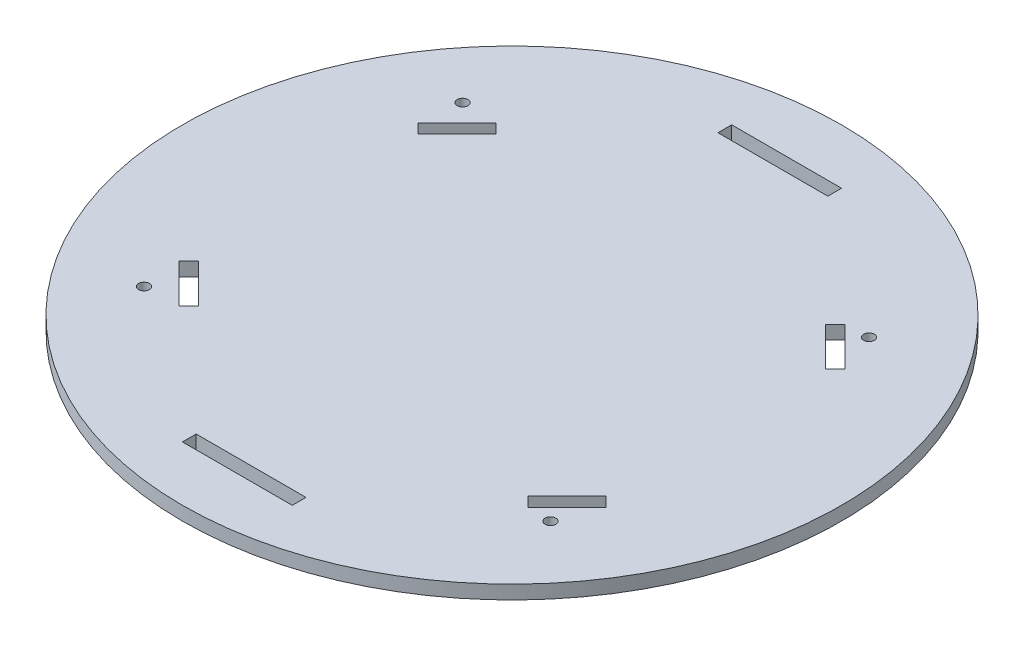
ISO-10303-21;
HEADER;
FILE_DESCRIPTION(('STEP AP214'),'2;1');
FILE_NAME('part.step','',(''),(''),'','','');
FILE_SCHEMA(('AUTOMOTIVE_DESIGN { 1 0 10303 214 1 1 1 1 }'));
ENDSEC;
DATA;
#1=APPLICATION_CONTEXT('core data for automotive mechanical design processes');
#2=APPLICATION_PROTOCOL_DEFINITION('international standard','automotive_design',2000,#1);
#3=PRODUCT_CONTEXT('',#1,'mechanical');
#4=PRODUCT('Part','Part','',(#3));
#5=PRODUCT_RELATED_PRODUCT_CATEGORY('part','',(#4));
#6=PRODUCT_DEFINITION_FORMATION('','',#4);
#7=PRODUCT_DEFINITION_CONTEXT('part definition',#1,'design');
#8=PRODUCT_DEFINITION('design','',#6,#7);
#9=PRODUCT_DEFINITION_SHAPE('','',#8);
#10=(LENGTH_UNIT() NAMED_UNIT(*) SI_UNIT(.MILLI.,.METRE.));
#11=(NAMED_UNIT(*) PLANE_ANGLE_UNIT() SI_UNIT($,.RADIAN.));
#12=(NAMED_UNIT(*) SI_UNIT($,.STERADIAN.) SOLID_ANGLE_UNIT());
#13=UNCERTAINTY_MEASURE_WITH_UNIT(LENGTH_MEASURE(1.E-05),#10,'distance_accuracy_value','');
#14=(GEOMETRIC_REPRESENTATION_CONTEXT(3) GLOBAL_UNCERTAINTY_ASSIGNED_CONTEXT((#13)) GLOBAL_UNIT_ASSIGNED_CONTEXT((#10,
#11,#12)) REPRESENTATION_CONTEXT('',''));
#15=CARTESIAN_POINT('',(0.,0.,0.));
#16=DIRECTION('',(0.,0.,1.));
#17=DIRECTION('',(1.,0.,0.));
#18=AXIS2_PLACEMENT_3D('',#15,#16,#17);
#19=CARTESIAN_POINT('',(0.,1.5875,0.));
#20=DIRECTION('',(0.,-1.,0.));
#21=DIRECTION('',(0.,0.,-1.));
#22=AXIS2_PLACEMENT_3D('',#19,#20,#21);
#23=CYLINDRICAL_SURFACE('',#22,76.2);
#24=CARTESIAN_POINT('',(0.,1.5875,0.));
#25=DIRECTION('',(0.,1.,0.));
#26=DIRECTION('',(0.,0.,1.));
#27=AXIS2_PLACEMENT_3D('',#24,#25,#26);
#28=CIRCLE('',#27,76.2);
#29=CARTESIAN_POINT('',(0.,1.5875,76.2));
#30=VERTEX_POINT('',#29);
#31=EDGE_CURVE('E11',#30,#30,#28,.T.);
#32=ORIENTED_EDGE('',*,*,#31,.F.);
#33=EDGE_LOOP('',(#32));
#34=FACE_BOUND('',#33,.T.);
#35=CARTESIAN_POINT('',(0.,-1.5875,0.));
#36=DIRECTION('',(0.,1.,0.));
#37=DIRECTION('',(0.,0.,1.));
#38=AXIS2_PLACEMENT_3D('',#35,#36,#37);
#39=CIRCLE('',#38,76.2);
#40=CARTESIAN_POINT('',(0.,-1.5875,76.2));
#41=VERTEX_POINT('',#40);
#42=EDGE_CURVE('E33',#41,#41,#39,.T.);
#43=ORIENTED_EDGE('',*,*,#42,.T.);
#44=EDGE_LOOP('',(#43));
#45=FACE_BOUND('',#44,.T.);
#46=ADVANCED_FACE('F30',(#34,#45),#23,.T.);
#47=CARTESIAN_POINT('',(0.,1.5875,0.));
#48=DIRECTION('',(0.,1.,0.));
#49=DIRECTION('',(0.,0.,1.));
#50=AXIS2_PLACEMENT_3D('',#47,#48,#49);
#51=PLANE('',#50);
#52=CARTESIAN_POINT('',(-48.26,1.5875,-36.83));
#53=DIRECTION('',(0.,1.,0.));
#54=DIRECTION('',(0.,0.,1.));
#55=AXIS2_PLACEMENT_3D('',#52,#53,#54);
#56=CIRCLE('',#55,1.24459999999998);
#57=CARTESIAN_POINT('',(-48.26,1.5875,-35.5854));
#58=VERTEX_POINT('',#57);
#59=EDGE_CURVE('E540',#58,#58,#56,.T.);
#60=ORIENTED_EDGE('',*,*,#59,.F.);
#61=EDGE_LOOP('',(#60));
#62=FACE_BOUND('',#61,.T.);
#63=CARTESIAN_POINT('',(45.72,1.5875,-36.83));
#64=DIRECTION('',(0.,1.,0.));
#65=DIRECTION('',(0.,0.,1.));
#66=AXIS2_PLACEMENT_3D('',#63,#64,#65);
#67=CIRCLE('',#66,1.24459999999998);
#68=CARTESIAN_POINT('',(45.72,1.5875,-35.5854));
#69=VERTEX_POINT('',#68);
#70=EDGE_CURVE('E542',#69,#69,#67,.T.);
#71=ORIENTED_EDGE('',*,*,#70,.F.);
#72=EDGE_LOOP('',(#71));
#73=FACE_BOUND('',#72,.T.);
#74=CARTESIAN_POINT('',(45.72,1.5875,36.83));
#75=DIRECTION('',(0.,1.,0.));
#76=DIRECTION('',(0.,0.,1.));
#77=AXIS2_PLACEMENT_3D('',#74,#75,#76);
#78=CIRCLE('',#77,1.24459999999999);
#79=CARTESIAN_POINT('',(45.72,1.5875,38.0746));
#80=VERTEX_POINT('',#79);
#81=EDGE_CURVE('E550',#80,#80,#78,.T.);
#82=ORIENTED_EDGE('',*,*,#81,.F.);
#83=EDGE_LOOP('',(#82));
#84=FACE_BOUND('',#83,.T.);
#85=CARTESIAN_POINT('',(-48.26,1.5875,36.83));
#86=DIRECTION('',(0.,1.,0.));
#87=DIRECTION('',(0.,0.,1.));
#88=AXIS2_PLACEMENT_3D('',#85,#86,#87);
#89=CIRCLE('',#88,1.24459999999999);
#90=CARTESIAN_POINT('',(-48.26,1.5875,38.0746));
#91=VERTEX_POINT('',#90);
#92=EDGE_CURVE('E555',#91,#91,#89,.T.);
#93=ORIENTED_EDGE('',*,*,#92,.F.);
#94=EDGE_LOOP('',(#93));
#95=FACE_BOUND('',#94,.T.);
#96=DIRECTION('',(0.,0.,1.));
#97=VECTOR('',#96,1.);
#98=CARTESIAN_POINT('',(-12.7000000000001,1.5875,-60.325));
#99=LINE('',#98,#97);
#100=CARTESIAN_POINT('',(-12.7000000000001,1.5875,-63.5));
#101=VERTEX_POINT('',#100);
#102=CARTESIAN_POINT('',(-12.7000000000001,1.5875,-60.325));
#103=VERTEX_POINT('',#102);
#104=EDGE_CURVE('E44',#101,#103,#99,.T.);
#105=ORIENTED_EDGE('',*,*,#104,.F.);
#106=DIRECTION('',(-1.,0.,0.));
#107=VECTOR('',#106,1.);
#108=CARTESIAN_POINT('',(-12.7000000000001,1.5875,-63.5));
#109=LINE('',#108,#107);
#110=CARTESIAN_POINT('',(12.6999999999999,1.5875,-63.5));
#111=VERTEX_POINT('',#110);
#112=EDGE_CURVE('E208',#111,#101,#109,.T.);
#113=ORIENTED_EDGE('',*,*,#112,.F.);
#114=DIRECTION('',(0.,0.,-1.));
#115=VECTOR('',#114,1.);
#116=CARTESIAN_POINT('',(12.6999999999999,1.5875,-60.325));
#117=LINE('',#116,#115);
#118=CARTESIAN_POINT('',(12.6999999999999,1.5875,-60.325));
#119=VERTEX_POINT('',#118);
#120=EDGE_CURVE('E211',#119,#111,#117,.T.);
#121=ORIENTED_EDGE('',*,*,#120,.F.);
#122=DIRECTION('',(1.,0.,0.));
#123=VECTOR('',#122,1.);
#124=CARTESIAN_POINT('',(-12.7000000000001,1.5875,-60.325));
#125=LINE('',#124,#123);
#126=EDGE_CURVE('E220',#103,#119,#125,.T.);
#127=ORIENTED_EDGE('',*,*,#126,.F.);
#128=EDGE_LOOP('',(#105,#113,#121,#127));
#129=FACE_BOUND('',#128,.T.);
#130=DIRECTION('',(0.,0.,-1.));
#131=VECTOR('',#130,1.);
#132=CARTESIAN_POINT('',(12.7,1.5875,60.325));
#133=LINE('',#132,#131);
#134=CARTESIAN_POINT('',(12.7,1.5875,63.5));
#135=VERTEX_POINT('',#134);
#136=CARTESIAN_POINT('',(12.7,1.5875,60.325));
#137=VERTEX_POINT('',#136);
#138=EDGE_CURVE('E226',#135,#137,#133,.T.);
#139=ORIENTED_EDGE('',*,*,#138,.F.);
#140=DIRECTION('',(1.,0.,0.));
#141=VECTOR('',#140,1.);
#142=CARTESIAN_POINT('',(-12.7,1.5875,63.5));
#143=LINE('',#142,#141);
#144=CARTESIAN_POINT('',(-12.7,1.5875,63.5));
#145=VERTEX_POINT('',#144);
#146=EDGE_CURVE('E234',#145,#135,#143,.T.);
#147=ORIENTED_EDGE('',*,*,#146,.F.);
#148=DIRECTION('',(0.,0.,1.));
#149=VECTOR('',#148,1.);
#150=CARTESIAN_POINT('',(-12.7,1.5875,60.325));
#151=LINE('',#150,#149);
#152=CARTESIAN_POINT('',(-12.7,1.5875,60.325));
#153=VERTEX_POINT('',#152);
#154=EDGE_CURVE('E248',#153,#145,#151,.T.);
#155=ORIENTED_EDGE('',*,*,#154,.F.);
#156=DIRECTION('',(-1.,0.,0.));
#157=VECTOR('',#156,1.);
#158=CARTESIAN_POINT('',(-12.7,1.5875,60.325));
#159=LINE('',#158,#157);
#160=EDGE_CURVE('E245',#137,#153,#159,.T.);
#161=ORIENTED_EDGE('',*,*,#160,.F.);
#162=EDGE_LOOP('',(#139,#147,#155,#161));
#163=FACE_BOUND('',#162,.T.);
#164=DIRECTION('',(0.707106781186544,0.,-0.707106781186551));
#165=VECTOR('',#164,1.);
#166=CARTESIAN_POINT('',(-40.3450640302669,1.5875,36.6253201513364));
#167=LINE('',#166,#165);
#168=CARTESIAN_POINT('',(-40.3450640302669,1.5875,36.6253201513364));
#169=VERTEX_POINT('',#168);
#170=CARTESIAN_POINT('',(-38.0999999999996,1.5875,34.3802561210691));
#171=VERTEX_POINT('',#170);
#172=EDGE_CURVE('E255',#169,#171,#167,.T.);
#173=ORIENTED_EDGE('',*,*,#172,.F.);
#174=DIRECTION('',(0.707106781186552,0.,0.707106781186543));
#175=VECTOR('',#174,1.);
#176=CARTESIAN_POINT('',(-40.3450640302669,1.5875,36.6253201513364));
#177=LINE('',#176,#175);
#178=CARTESIAN_POINT('',(-49.3253201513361,1.5875,27.6450640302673));
#179=VERTEX_POINT('',#178);
#180=EDGE_CURVE('E266',#179,#169,#177,.T.);
#181=ORIENTED_EDGE('',*,*,#180,.F.);
#182=DIRECTION('',(-0.707106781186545,0.,0.70710678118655));
#183=VECTOR('',#182,1.);
#184=CARTESIAN_POINT('',(-49.3253201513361,1.5875,27.6450640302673));
#185=LINE('',#184,#183);
#186=CARTESIAN_POINT('',(-47.0802561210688,1.5875,25.4));
#187=VERTEX_POINT('',#186);
#188=EDGE_CURVE('E280',#187,#179,#185,.T.);
#189=ORIENTED_EDGE('',*,*,#188,.F.);
#190=DIRECTION('',(-0.707106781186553,0.,-0.707106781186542));
#191=VECTOR('',#190,1.);
#192=CARTESIAN_POINT('',(-38.0999999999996,1.5875,34.3802561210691));
#193=LINE('',#192,#191);
#194=EDGE_CURVE('E277',#171,#187,#193,.T.);
#195=ORIENTED_EDGE('',*,*,#194,.F.);
#196=EDGE_LOOP('',(#173,#181,#189,#195));
#197=FACE_BOUND('',#196,.T.);
#198=DIRECTION('',(0.707106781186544,0.,0.707106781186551));
#199=VECTOR('',#198,1.);
#200=CARTESIAN_POINT('',(40.3450640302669,1.5875,36.6253201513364));
#201=LINE('',#200,#199);
#202=CARTESIAN_POINT('',(38.0999999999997,1.5875,34.3802561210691));
#203=VERTEX_POINT('',#202);
#204=CARTESIAN_POINT('',(40.3450640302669,1.5875,36.6253201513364));
#205=VERTEX_POINT('',#204);
#206=EDGE_CURVE('E287',#203,#205,#201,.T.);
#207=ORIENTED_EDGE('',*,*,#206,.F.);
#208=DIRECTION('',(-0.707106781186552,0.,0.707106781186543));
#209=VECTOR('',#208,1.);
#210=CARTESIAN_POINT('',(38.0999999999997,1.5875,34.3802561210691));
#211=LINE('',#210,#209);
#212=CARTESIAN_POINT('',(47.0802561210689,1.5875,25.4));
#213=VERTEX_POINT('',#212);
#214=EDGE_CURVE('E298',#213,#203,#211,.T.);
#215=ORIENTED_EDGE('',*,*,#214,.F.);
#216=DIRECTION('',(-0.707106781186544,0.,-0.707106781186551));
#217=VECTOR('',#216,1.);
#218=CARTESIAN_POINT('',(49.3253201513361,1.5875,27.6450640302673));
#219=LINE('',#218,#217);
#220=CARTESIAN_POINT('',(49.3253201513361,1.5875,27.6450640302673));
#221=VERTEX_POINT('',#220);
#222=EDGE_CURVE('E312',#221,#213,#219,.T.);
#223=ORIENTED_EDGE('',*,*,#222,.F.);
#224=DIRECTION('',(0.707106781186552,0.,-0.707106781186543));
#225=VECTOR('',#224,1.);
#226=CARTESIAN_POINT('',(40.3450640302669,1.5875,36.6253201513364));
#227=LINE('',#226,#225);
#228=EDGE_CURVE('E309',#205,#221,#227,.T.);
#229=ORIENTED_EDGE('',*,*,#228,.F.);
#230=EDGE_LOOP('',(#207,#215,#223,#229));
#231=FACE_BOUND('',#230,.T.);
#232=DIRECTION('',(-0.707106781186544,0.,0.707106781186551));
#233=VECTOR('',#232,1.);
#234=CARTESIAN_POINT('',(40.3450640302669,1.5875,-36.6253201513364));
#235=LINE('',#234,#233);
#236=CARTESIAN_POINT('',(40.3450640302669,1.5875,-36.6253201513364));
#237=VERTEX_POINT('',#236);
#238=CARTESIAN_POINT('',(38.0999999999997,1.5875,-34.3802561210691));
#239=VERTEX_POINT('',#238);
#240=EDGE_CURVE('E319',#237,#239,#235,.T.);
#241=ORIENTED_EDGE('',*,*,#240,.F.);
#242=DIRECTION('',(-0.707106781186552,0.,-0.707106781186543));
#243=VECTOR('',#242,1.);
#244=CARTESIAN_POINT('',(40.3450640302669,1.5875,-36.6253201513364));
#245=LINE('',#244,#243);
#246=CARTESIAN_POINT('',(49.3253201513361,1.5875,-27.6450640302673));
#247=VERTEX_POINT('',#246);
#248=EDGE_CURVE('E330',#247,#237,#245,.T.);
#249=ORIENTED_EDGE('',*,*,#248,.F.);
#250=DIRECTION('',(0.707106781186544,0.,-0.707106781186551));
#251=VECTOR('',#250,1.);
#252=CARTESIAN_POINT('',(49.3253201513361,1.5875,-27.6450640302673));
#253=LINE('',#252,#251);
#254=CARTESIAN_POINT('',(47.0802561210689,1.5875,-25.4));
#255=VERTEX_POINT('',#254);
#256=EDGE_CURVE('E344',#255,#247,#253,.T.);
#257=ORIENTED_EDGE('',*,*,#256,.F.);
#258=DIRECTION('',(0.707106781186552,0.,0.707106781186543));
#259=VECTOR('',#258,1.);
#260=CARTESIAN_POINT('',(38.0999999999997,1.5875,-34.3802561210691));
#261=LINE('',#260,#259);
#262=EDGE_CURVE('E341',#239,#255,#261,.T.);
#263=ORIENTED_EDGE('',*,*,#262,.F.);
#264=EDGE_LOOP('',(#241,#249,#257,#263));
#265=FACE_BOUND('',#264,.T.);
#266=DIRECTION('',(-0.707106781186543,0.,-0.707106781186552));
#267=VECTOR('',#266,1.);
#268=CARTESIAN_POINT('',(-40.3450640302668,1.5875,-36.6253201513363));
#269=LINE('',#268,#267);
#270=CARTESIAN_POINT('',(-38.0999999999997,1.5875,-34.3802561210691));
#271=VERTEX_POINT('',#270);
#272=CARTESIAN_POINT('',(-40.3450640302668,1.5875,-36.6253201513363));
#273=VERTEX_POINT('',#272);
#274=EDGE_CURVE('E351',#271,#273,#269,.T.);
#275=ORIENTED_EDGE('',*,*,#274,.F.);
#276=DIRECTION('',(0.707106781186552,0.,-0.707106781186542));
#277=VECTOR('',#276,1.);
#278=CARTESIAN_POINT('',(-38.0999999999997,1.5875,-34.3802561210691));
#279=LINE('',#278,#277);
#280=CARTESIAN_POINT('',(-47.0802561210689,1.5875,-25.4));
#281=VERTEX_POINT('',#280);
#282=EDGE_CURVE('E362',#281,#271,#279,.T.);
#283=ORIENTED_EDGE('',*,*,#282,.F.);
#284=DIRECTION('',(0.707106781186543,0.,0.707106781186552));
#285=VECTOR('',#284,1.);
#286=CARTESIAN_POINT('',(-49.3253201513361,1.5875,-27.6450640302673));
#287=LINE('',#286,#285);
#288=CARTESIAN_POINT('',(-49.3253201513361,1.5875,-27.6450640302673));
#289=VERTEX_POINT('',#288);
#290=EDGE_CURVE('E376',#289,#281,#287,.T.);
#291=ORIENTED_EDGE('',*,*,#290,.F.);
#292=DIRECTION('',(-0.70710678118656,0.,0.707106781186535));
#293=VECTOR('',#292,1.);
#294=CARTESIAN_POINT('',(-40.3450640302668,1.5875,-36.6253201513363));
#295=LINE('',#294,#293);
#296=EDGE_CURVE('E373',#273,#289,#295,.T.);
#297=ORIENTED_EDGE('',*,*,#296,.F.);
#298=EDGE_LOOP('',(#275,#283,#291,#297));
#299=FACE_BOUND('',#298,.T.);
#300=ORIENTED_EDGE('',*,*,#31,.T.);
#301=EDGE_LOOP('',(#300));
#302=FACE_BOUND('',#301,.T.);
#303=ADVANCED_FACE('F398',(#62,#73,#84,#95,#129,#163,#197,#231,#265,#299,#302),#51,.T.);
#304=CARTESIAN_POINT('',(0.,-1.5875,0.));
#305=DIRECTION('',(0.,1.,0.));
#306=DIRECTION('',(0.,0.,1.));
#307=AXIS2_PLACEMENT_3D('',#304,#305,#306);
#308=PLANE('',#307);
#309=CARTESIAN_POINT('',(-48.26,-1.5875,-36.83));
#310=DIRECTION('',(0.,1.,0.));
#311=DIRECTION('',(0.,0.,1.));
#312=AXIS2_PLACEMENT_3D('',#309,#310,#311);
#313=CIRCLE('',#312,1.2446);
#314=CARTESIAN_POINT('',(-48.26,-1.5875,-35.5854));
#315=VERTEX_POINT('',#314);
#316=EDGE_CURVE('E537',#315,#315,#313,.T.);
#317=ORIENTED_EDGE('',*,*,#316,.T.);
#318=EDGE_LOOP('',(#317));
#319=FACE_BOUND('',#318,.T.);
#320=CARTESIAN_POINT('',(45.72,-1.5875,-36.83));
#321=DIRECTION('',(0.,1.,0.));
#322=DIRECTION('',(0.,0.,1.));
#323=AXIS2_PLACEMENT_3D('',#320,#321,#322);
#324=CIRCLE('',#323,1.2446);
#325=CARTESIAN_POINT('',(45.72,-1.5875,-35.5854));
#326=VERTEX_POINT('',#325);
#327=EDGE_CURVE('E547',#326,#326,#324,.T.);
#328=ORIENTED_EDGE('',*,*,#327,.T.);
#329=EDGE_LOOP('',(#328));
#330=FACE_BOUND('',#329,.T.);
#331=CARTESIAN_POINT('',(45.72,-1.5875,36.83));
#332=DIRECTION('',(0.,1.,0.));
#333=DIRECTION('',(0.,0.,1.));
#334=AXIS2_PLACEMENT_3D('',#331,#332,#333);
#335=CIRCLE('',#334,1.2446);
#336=CARTESIAN_POINT('',(45.72,-1.5875,38.0746));
#337=VERTEX_POINT('',#336);
#338=EDGE_CURVE('E553',#337,#337,#335,.T.);
#339=ORIENTED_EDGE('',*,*,#338,.T.);
#340=EDGE_LOOP('',(#339));
#341=FACE_BOUND('',#340,.T.);
#342=CARTESIAN_POINT('',(-48.26,-1.5875,36.83));
#343=DIRECTION('',(0.,1.,0.));
#344=DIRECTION('',(0.,0.,1.));
#345=AXIS2_PLACEMENT_3D('',#342,#343,#344);
#346=CIRCLE('',#345,1.2446);
#347=CARTESIAN_POINT('',(-48.26,-1.5875,38.0746));
#348=VERTEX_POINT('',#347);
#349=EDGE_CURVE('E214',#348,#348,#346,.T.);
#350=ORIENTED_EDGE('',*,*,#349,.T.);
#351=EDGE_LOOP('',(#350));
#352=FACE_BOUND('',#351,.T.);
#353=DIRECTION('',(-1.,0.,0.));
#354=VECTOR('',#353,1.);
#355=CARTESIAN_POINT('',(-12.7000000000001,-1.5875,-63.5));
#356=LINE('',#355,#354);
#357=CARTESIAN_POINT('',(12.6999999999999,-1.5875,-63.5));
#358=VERTEX_POINT('',#357);
#359=CARTESIAN_POINT('',(-12.7000000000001,-1.5875,-63.5));
#360=VERTEX_POINT('',#359);
#361=EDGE_CURVE('E198',#358,#360,#356,.T.);
#362=ORIENTED_EDGE('',*,*,#361,.T.);
#363=DIRECTION('',(0.,0.,1.));
#364=VECTOR('',#363,1.);
#365=CARTESIAN_POINT('',(-12.7000000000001,-1.5875,-60.325));
#366=LINE('',#365,#364);
#367=CARTESIAN_POINT('',(-12.7000000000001,-1.5875,-60.325));
#368=VERTEX_POINT('',#367);
#369=EDGE_CURVE('E192',#360,#368,#366,.T.);
#370=ORIENTED_EDGE('',*,*,#369,.T.);
#371=DIRECTION('',(1.,0.,0.));
#372=VECTOR('',#371,1.);
#373=CARTESIAN_POINT('',(-12.7000000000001,-1.5875,-60.325));
#374=LINE('',#373,#372);
#375=CARTESIAN_POINT('',(12.6999999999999,-1.5875,-60.325));
#376=VERTEX_POINT('',#375);
#377=EDGE_CURVE('E201',#368,#376,#374,.T.);
#378=ORIENTED_EDGE('',*,*,#377,.T.);
#379=DIRECTION('',(0.,0.,-1.));
#380=VECTOR('',#379,1.);
#381=CARTESIAN_POINT('',(12.6999999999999,-1.5875,-60.325));
#382=LINE('',#381,#380);
#383=EDGE_CURVE('E52',#376,#358,#382,.T.);
#384=ORIENTED_EDGE('',*,*,#383,.T.);
#385=EDGE_LOOP('',(#362,#370,#378,#384));
#386=FACE_BOUND('',#385,.T.);
#387=DIRECTION('',(1.,0.,0.));
#388=VECTOR('',#387,1.);
#389=CARTESIAN_POINT('',(-12.7,-1.5875,63.5));
#390=LINE('',#389,#388);
#391=CARTESIAN_POINT('',(-12.7,-1.5875,63.5));
#392=VERTEX_POINT('',#391);
#393=CARTESIAN_POINT('',(12.7,-1.5875,63.5));
#394=VERTEX_POINT('',#393);
#395=EDGE_CURVE('E240',#392,#394,#390,.T.);
#396=ORIENTED_EDGE('',*,*,#395,.T.);
#397=DIRECTION('',(0.,0.,-1.));
#398=VECTOR('',#397,1.);
#399=CARTESIAN_POINT('',(12.7,-1.5875,60.325));
#400=LINE('',#399,#398);
#401=CARTESIAN_POINT('',(12.7,-1.5875,60.325));
#402=VERTEX_POINT('',#401);
#403=EDGE_CURVE('E230',#394,#402,#400,.T.);
#404=ORIENTED_EDGE('',*,*,#403,.T.);
#405=DIRECTION('',(-1.,0.,0.));
#406=VECTOR('',#405,1.);
#407=CARTESIAN_POINT('',(-12.7,-1.5875,60.325));
#408=LINE('',#407,#406);
#409=CARTESIAN_POINT('',(-12.7,-1.5875,60.325));
#410=VERTEX_POINT('',#409);
#411=EDGE_CURVE('E233',#402,#410,#408,.T.);
#412=ORIENTED_EDGE('',*,*,#411,.T.);
#413=DIRECTION('',(0.,0.,1.));
#414=VECTOR('',#413,1.);
#415=CARTESIAN_POINT('',(-12.7,-1.5875,60.325));
#416=LINE('',#415,#414);
#417=EDGE_CURVE('E237',#410,#392,#416,.T.);
#418=ORIENTED_EDGE('',*,*,#417,.T.);
#419=EDGE_LOOP('',(#396,#404,#412,#418));
#420=FACE_BOUND('',#419,.T.);
#421=DIRECTION('',(0.707106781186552,0.,0.707106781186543));
#422=VECTOR('',#421,1.);
#423=CARTESIAN_POINT('',(-40.3450640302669,-1.5875,36.6253201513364));
#424=LINE('',#423,#422);
#425=CARTESIAN_POINT('',(-49.3253201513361,-1.5875,27.6450640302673));
#426=VERTEX_POINT('',#425);
#427=CARTESIAN_POINT('',(-40.3450640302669,-1.5875,36.6253201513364));
#428=VERTEX_POINT('',#427);
#429=EDGE_CURVE('E272',#426,#428,#424,.T.);
#430=ORIENTED_EDGE('',*,*,#429,.T.);
#431=DIRECTION('',(0.707106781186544,0.,-0.707106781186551));
#432=VECTOR('',#431,1.);
#433=CARTESIAN_POINT('',(-40.3450640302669,-1.5875,36.6253201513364));
#434=LINE('',#433,#432);
#435=CARTESIAN_POINT('',(-38.0999999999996,-1.5875,34.3802561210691));
#436=VERTEX_POINT('',#435);
#437=EDGE_CURVE('E262',#428,#436,#434,.T.);
#438=ORIENTED_EDGE('',*,*,#437,.T.);
#439=DIRECTION('',(-0.707106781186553,0.,-0.707106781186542));
#440=VECTOR('',#439,1.);
#441=CARTESIAN_POINT('',(-38.0999999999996,-1.5875,34.3802561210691));
#442=LINE('',#441,#440);
#443=CARTESIAN_POINT('',(-47.0802561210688,-1.5875,25.4));
#444=VERTEX_POINT('',#443);
#445=EDGE_CURVE('E265',#436,#444,#442,.T.);
#446=ORIENTED_EDGE('',*,*,#445,.T.);
#447=DIRECTION('',(-0.707106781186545,0.,0.70710678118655));
#448=VECTOR('',#447,1.);
#449=CARTESIAN_POINT('',(-49.3253201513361,-1.5875,27.6450640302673));
#450=LINE('',#449,#448);
#451=EDGE_CURVE('E269',#444,#426,#450,.T.);
#452=ORIENTED_EDGE('',*,*,#451,.T.);
#453=EDGE_LOOP('',(#430,#438,#446,#452));
#454=FACE_BOUND('',#453,.T.);
#455=DIRECTION('',(-0.707106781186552,0.,0.707106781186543));
#456=VECTOR('',#455,1.);
#457=CARTESIAN_POINT('',(38.0999999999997,-1.5875,34.3802561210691));
#458=LINE('',#457,#456);
#459=CARTESIAN_POINT('',(47.0802561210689,-1.5875,25.4));
#460=VERTEX_POINT('',#459);
#461=CARTESIAN_POINT('',(38.0999999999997,-1.5875,34.3802561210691));
#462=VERTEX_POINT('',#461);
#463=EDGE_CURVE('E304',#460,#462,#458,.T.);
#464=ORIENTED_EDGE('',*,*,#463,.T.);
#465=DIRECTION('',(0.707106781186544,0.,0.707106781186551));
#466=VECTOR('',#465,1.);
#467=CARTESIAN_POINT('',(40.3450640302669,-1.5875,36.6253201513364));
#468=LINE('',#467,#466);
#469=CARTESIAN_POINT('',(40.3450640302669,-1.5875,36.6253201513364));
#470=VERTEX_POINT('',#469);
#471=EDGE_CURVE('E294',#462,#470,#468,.T.);
#472=ORIENTED_EDGE('',*,*,#471,.T.);
#473=DIRECTION('',(0.707106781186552,0.,-0.707106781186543));
#474=VECTOR('',#473,1.);
#475=CARTESIAN_POINT('',(40.3450640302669,-1.5875,36.6253201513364));
#476=LINE('',#475,#474);
#477=CARTESIAN_POINT('',(49.3253201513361,-1.5875,27.6450640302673));
#478=VERTEX_POINT('',#477);
#479=EDGE_CURVE('E297',#470,#478,#476,.T.);
#480=ORIENTED_EDGE('',*,*,#479,.T.);
#481=DIRECTION('',(-0.707106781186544,0.,-0.707106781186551));
#482=VECTOR('',#481,1.);
#483=CARTESIAN_POINT('',(49.3253201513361,-1.5875,27.6450640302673));
#484=LINE('',#483,#482);
#485=EDGE_CURVE('E301',#478,#460,#484,.T.);
#486=ORIENTED_EDGE('',*,*,#485,.T.);
#487=EDGE_LOOP('',(#464,#472,#480,#486));
#488=FACE_BOUND('',#487,.T.);
#489=DIRECTION('',(-0.707106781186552,0.,-0.707106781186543));
#490=VECTOR('',#489,1.);
#491=CARTESIAN_POINT('',(40.3450640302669,-1.5875,-36.6253201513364));
#492=LINE('',#491,#490);
#493=CARTESIAN_POINT('',(49.3253201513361,-1.5875,-27.6450640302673));
#494=VERTEX_POINT('',#493);
#495=CARTESIAN_POINT('',(40.3450640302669,-1.5875,-36.6253201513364));
#496=VERTEX_POINT('',#495);
#497=EDGE_CURVE('E336',#494,#496,#492,.T.);
#498=ORIENTED_EDGE('',*,*,#497,.T.);
#499=DIRECTION('',(-0.707106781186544,0.,0.707106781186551));
#500=VECTOR('',#499,1.);
#501=CARTESIAN_POINT('',(40.3450640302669,-1.5875,-36.6253201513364));
#502=LINE('',#501,#500);
#503=CARTESIAN_POINT('',(38.0999999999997,-1.5875,-34.3802561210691));
#504=VERTEX_POINT('',#503);
#505=EDGE_CURVE('E326',#496,#504,#502,.T.);
#506=ORIENTED_EDGE('',*,*,#505,.T.);
#507=DIRECTION('',(0.707106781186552,0.,0.707106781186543));
#508=VECTOR('',#507,1.);
#509=CARTESIAN_POINT('',(38.0999999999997,-1.5875,-34.3802561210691));
#510=LINE('',#509,#508);
#511=CARTESIAN_POINT('',(47.0802561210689,-1.5875,-25.4));
#512=VERTEX_POINT('',#511);
#513=EDGE_CURVE('E329',#504,#512,#510,.T.);
#514=ORIENTED_EDGE('',*,*,#513,.T.);
#515=DIRECTION('',(0.707106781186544,0.,-0.707106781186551));
#516=VECTOR('',#515,1.);
#517=CARTESIAN_POINT('',(49.3253201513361,-1.5875,-27.6450640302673));
#518=LINE('',#517,#516);
#519=EDGE_CURVE('E333',#512,#494,#518,.T.);
#520=ORIENTED_EDGE('',*,*,#519,.T.);
#521=EDGE_LOOP('',(#498,#506,#514,#520));
#522=FACE_BOUND('',#521,.T.);
#523=DIRECTION('',(0.707106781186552,0.,-0.707106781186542));
#524=VECTOR('',#523,1.);
#525=CARTESIAN_POINT('',(-38.0999999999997,-1.5875,-34.3802561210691));
#526=LINE('',#525,#524);
#527=CARTESIAN_POINT('',(-47.0802561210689,-1.5875,-25.4));
#528=VERTEX_POINT('',#527);
#529=CARTESIAN_POINT('',(-38.0999999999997,-1.5875,-34.3802561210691));
#530=VERTEX_POINT('',#529);
#531=EDGE_CURVE('E368',#528,#530,#526,.T.);
#532=ORIENTED_EDGE('',*,*,#531,.T.);
#533=DIRECTION('',(-0.707106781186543,0.,-0.707106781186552));
#534=VECTOR('',#533,1.);
#535=CARTESIAN_POINT('',(-40.3450640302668,-1.5875,-36.6253201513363));
#536=LINE('',#535,#534);
#537=CARTESIAN_POINT('',(-40.3450640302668,-1.5875,-36.6253201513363));
#538=VERTEX_POINT('',#537);
#539=EDGE_CURVE('E358',#530,#538,#536,.T.);
#540=ORIENTED_EDGE('',*,*,#539,.T.);
#541=DIRECTION('',(-0.70710678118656,0.,0.707106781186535));
#542=VECTOR('',#541,1.);
#543=CARTESIAN_POINT('',(-40.3450640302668,-1.5875,-36.6253201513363));
#544=LINE('',#543,#542);
#545=CARTESIAN_POINT('',(-49.3253201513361,-1.5875,-27.6450640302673));
#546=VERTEX_POINT('',#545);
#547=EDGE_CURVE('E361',#538,#546,#544,.T.);
#548=ORIENTED_EDGE('',*,*,#547,.T.);
#549=DIRECTION('',(0.707106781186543,0.,0.707106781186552));
#550=VECTOR('',#549,1.);
#551=CARTESIAN_POINT('',(-49.3253201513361,-1.5875,-27.6450640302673));
#552=LINE('',#551,#550);
#553=EDGE_CURVE('E365',#546,#528,#552,.T.);
#554=ORIENTED_EDGE('',*,*,#553,.T.);
#555=EDGE_LOOP('',(#532,#540,#548,#554));
#556=FACE_BOUND('',#555,.T.);
#557=ORIENTED_EDGE('',*,*,#42,.F.);
#558=EDGE_LOOP('',(#557));
#559=FACE_BOUND('',#558,.T.);
#560=ADVANCED_FACE('F205',(#319,#330,#341,#352,#386,#420,#454,#488,#522,#556,#559),#308,.F.);
#561=CARTESIAN_POINT('',(-40.3450640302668,-1.5875,-36.6253201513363));
#562=DIRECTION('',(0.707106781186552,0.,-0.707106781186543));
#563=DIRECTION('',(-0.707106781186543,0.,-0.707106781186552));
#564=AXIS2_PLACEMENT_3D('',#561,#562,#563);
#565=PLANE('',#564);
#566=ORIENTED_EDGE('',*,*,#274,.T.);
#567=DIRECTION('',(0.,1.,0.));
#568=VECTOR('',#567,1.);
#569=CARTESIAN_POINT('',(-40.3450640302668,-1.5875,-36.6253201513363));
#570=LINE('',#569,#568);
#571=EDGE_CURVE('E371',#538,#273,#570,.T.);
#572=ORIENTED_EDGE('',*,*,#571,.F.);
#573=ORIENTED_EDGE('',*,*,#539,.F.);
#574=DIRECTION('',(0.,1.,0.));
#575=VECTOR('',#574,1.);
#576=CARTESIAN_POINT('',(-38.0999999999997,-1.5875,-34.3802561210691));
#577=LINE('',#576,#575);
#578=EDGE_CURVE('E381',#530,#271,#577,.T.);
#579=ORIENTED_EDGE('',*,*,#578,.T.);
#580=EDGE_LOOP('',(#566,#572,#573,#579));
#581=FACE_BOUND('',#580,.T.);
#582=ADVANCED_FACE('F406',(#581),#565,.F.);
#583=CARTESIAN_POINT('',(-38.0999999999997,-1.5875,-34.3802561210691));
#584=DIRECTION('',(0.707106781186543,0.,0.707106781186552));
#585=DIRECTION('',(0.707106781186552,0.,-0.707106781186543));
#586=AXIS2_PLACEMENT_3D('',#583,#584,#585);
#587=PLANE('',#586);
#588=ORIENTED_EDGE('',*,*,#282,.T.);
#589=ORIENTED_EDGE('',*,*,#578,.F.);
#590=ORIENTED_EDGE('',*,*,#531,.F.);
#591=DIRECTION('',(0.,1.,0.));
#592=VECTOR('',#591,1.);
#593=CARTESIAN_POINT('',(-47.0802561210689,-1.5875,-25.4));
#594=LINE('',#593,#592);
#595=EDGE_CURVE('E383',#528,#281,#594,.T.);
#596=ORIENTED_EDGE('',*,*,#595,.T.);
#597=EDGE_LOOP('',(#588,#589,#590,#596));
#598=FACE_BOUND('',#597,.T.);
#599=ADVANCED_FACE('F408',(#598),#587,.F.);
#600=CARTESIAN_POINT('',(-49.3253201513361,-1.5875,-27.6450640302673));
#601=DIRECTION('',(-0.707106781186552,0.,0.707106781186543));
#602=DIRECTION('',(0.707106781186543,0.,0.707106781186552));
#603=AXIS2_PLACEMENT_3D('',#600,#601,#602);
#604=PLANE('',#603);
#605=ORIENTED_EDGE('',*,*,#290,.T.);
#606=ORIENTED_EDGE('',*,*,#595,.F.);
#607=ORIENTED_EDGE('',*,*,#553,.F.);
#608=DIRECTION('',(0.,1.,0.));
#609=VECTOR('',#608,1.);
#610=CARTESIAN_POINT('',(-49.3253201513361,-1.5875,-27.6450640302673));
#611=LINE('',#610,#609);
#612=EDGE_CURVE('E385',#546,#289,#611,.T.);
#613=ORIENTED_EDGE('',*,*,#612,.T.);
#614=EDGE_LOOP('',(#605,#606,#607,#613));
#615=FACE_BOUND('',#614,.T.);
#616=ADVANCED_FACE('F402',(#615),#604,.F.);
#617=CARTESIAN_POINT('',(-40.3450640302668,-1.5875,-36.6253201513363));
#618=DIRECTION('',(-0.707106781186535,0.,-0.70710678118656));
#619=DIRECTION('',(-0.70710678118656,0.,0.707106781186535));
#620=AXIS2_PLACEMENT_3D('',#617,#618,#619);
#621=PLANE('',#620);
#622=ORIENTED_EDGE('',*,*,#296,.T.);
#623=ORIENTED_EDGE('',*,*,#612,.F.);
#624=ORIENTED_EDGE('',*,*,#547,.F.);
#625=ORIENTED_EDGE('',*,*,#571,.T.);
#626=EDGE_LOOP('',(#622,#623,#624,#625));
#627=FACE_BOUND('',#626,.T.);
#628=ADVANCED_FACE('F391',(#627),#621,.F.);
#629=CARTESIAN_POINT('',(40.3450640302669,-1.5875,-36.6253201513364));
#630=DIRECTION('',(-0.707106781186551,0.,-0.707106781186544));
#631=DIRECTION('',(-0.707106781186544,0.,0.707106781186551));
#632=AXIS2_PLACEMENT_3D('',#629,#630,#631);
#633=PLANE('',#632);
#634=ORIENTED_EDGE('',*,*,#240,.T.);
#635=DIRECTION('',(0.,1.,0.));
#636=VECTOR('',#635,1.);
#637=CARTESIAN_POINT('',(38.0999999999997,-1.5875,-34.3802561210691));
#638=LINE('',#637,#636);
#639=EDGE_CURVE('E339',#504,#239,#638,.T.);
#640=ORIENTED_EDGE('',*,*,#639,.F.);
#641=ORIENTED_EDGE('',*,*,#505,.F.);
#642=DIRECTION('',(0.,1.,0.));
#643=VECTOR('',#642,1.);
#644=CARTESIAN_POINT('',(40.3450640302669,-1.5875,-36.6253201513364));
#645=LINE('',#644,#643);
#646=EDGE_CURVE('E349',#496,#237,#645,.T.);
#647=ORIENTED_EDGE('',*,*,#646,.T.);
#648=EDGE_LOOP('',(#634,#640,#641,#647));
#649=FACE_BOUND('',#648,.T.);
#650=ADVANCED_FACE('F439',(#649),#633,.F.);
#651=CARTESIAN_POINT('',(40.3450640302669,-1.5875,-36.6253201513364));
#652=DIRECTION('',(0.707106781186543,0.,-0.707106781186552));
#653=DIRECTION('',(-0.707106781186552,0.,-0.707106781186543));
#654=AXIS2_PLACEMENT_3D('',#651,#652,#653);
#655=PLANE('',#654);
#656=ORIENTED_EDGE('',*,*,#248,.T.);
#657=ORIENTED_EDGE('',*,*,#646,.F.);
#658=ORIENTED_EDGE('',*,*,#497,.F.);
#659=DIRECTION('',(0.,1.,0.));
#660=VECTOR('',#659,1.);
#661=CARTESIAN_POINT('',(49.3253201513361,-1.5875,-27.6450640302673));
#662=LINE('',#661,#660);
#663=EDGE_CURVE('E352',#494,#247,#662,.T.);
#664=ORIENTED_EDGE('',*,*,#663,.T.);
#665=EDGE_LOOP('',(#656,#657,#658,#664));
#666=FACE_BOUND('',#665,.T.);
#667=ADVANCED_FACE('F443',(#666),#655,.F.);
#668=CARTESIAN_POINT('',(49.3253201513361,-1.5875,-27.6450640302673));
#669=DIRECTION('',(0.707106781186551,0.,0.707106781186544));
#670=DIRECTION('',(0.707106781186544,0.,-0.707106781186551));
#671=AXIS2_PLACEMENT_3D('',#668,#669,#670);
#672=PLANE('',#671);
#673=ORIENTED_EDGE('',*,*,#256,.T.);
#674=ORIENTED_EDGE('',*,*,#663,.F.);
#675=ORIENTED_EDGE('',*,*,#519,.F.);
#676=DIRECTION('',(0.,1.,0.));
#677=VECTOR('',#676,1.);
#678=CARTESIAN_POINT('',(47.0802561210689,-1.5875,-25.4));
#679=LINE('',#678,#677);
#680=EDGE_CURVE('E354',#512,#255,#679,.T.);
#681=ORIENTED_EDGE('',*,*,#680,.T.);
#682=EDGE_LOOP('',(#673,#674,#675,#681));
#683=FACE_BOUND('',#682,.T.);
#684=ADVANCED_FACE('F448',(#683),#672,.F.);
#685=CARTESIAN_POINT('',(38.0999999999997,-1.5875,-34.3802561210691));
#686=DIRECTION('',(-0.707106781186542,0.,0.707106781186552));
#687=DIRECTION('',(0.707106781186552,0.,0.707106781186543));
#688=AXIS2_PLACEMENT_3D('',#685,#686,#687);
#689=PLANE('',#688);
#690=ORIENTED_EDGE('',*,*,#262,.T.);
#691=ORIENTED_EDGE('',*,*,#680,.F.);
#692=ORIENTED_EDGE('',*,*,#513,.F.);
#693=ORIENTED_EDGE('',*,*,#639,.T.);
#694=EDGE_LOOP('',(#690,#691,#692,#693));
#695=FACE_BOUND('',#694,.T.);
#696=ADVANCED_FACE('F452',(#695),#689,.F.);
#697=CARTESIAN_POINT('',(40.3450640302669,-1.5875,36.6253201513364));
#698=DIRECTION('',(-0.707106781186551,0.,0.707106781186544));
#699=DIRECTION('',(0.707106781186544,0.,0.707106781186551));
#700=AXIS2_PLACEMENT_3D('',#697,#698,#699);
#701=PLANE('',#700);
#702=ORIENTED_EDGE('',*,*,#206,.T.);
#703=DIRECTION('',(0.,1.,0.));
#704=VECTOR('',#703,1.);
#705=CARTESIAN_POINT('',(40.3450640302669,-1.5875,36.6253201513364));
#706=LINE('',#705,#704);
#707=EDGE_CURVE('E307',#470,#205,#706,.T.);
#708=ORIENTED_EDGE('',*,*,#707,.F.);
#709=ORIENTED_EDGE('',*,*,#471,.F.);
#710=DIRECTION('',(0.,1.,0.));
#711=VECTOR('',#710,1.);
#712=CARTESIAN_POINT('',(38.0999999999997,-1.5875,34.3802561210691));
#713=LINE('',#712,#711);
#714=EDGE_CURVE('E317',#462,#203,#713,.T.);
#715=ORIENTED_EDGE('',*,*,#714,.T.);
#716=EDGE_LOOP('',(#702,#708,#709,#715));
#717=FACE_BOUND('',#716,.T.);
#718=ADVANCED_FACE('F455',(#717),#701,.F.);
#719=CARTESIAN_POINT('',(38.0999999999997,-1.5875,34.3802561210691));
#720=DIRECTION('',(-0.707106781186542,0.,-0.707106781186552));
#721=DIRECTION('',(-0.707106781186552,0.,0.707106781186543));
#722=AXIS2_PLACEMENT_3D('',#719,#720,#721);
#723=PLANE('',#722);
#724=ORIENTED_EDGE('',*,*,#214,.T.);
#725=ORIENTED_EDGE('',*,*,#714,.F.);
#726=ORIENTED_EDGE('',*,*,#463,.F.);
#727=DIRECTION('',(0.,1.,0.));
#728=VECTOR('',#727,1.);
#729=CARTESIAN_POINT('',(47.0802561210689,-1.5875,25.4));
#730=LINE('',#729,#728);
#731=EDGE_CURVE('E320',#460,#213,#730,.T.);
#732=ORIENTED_EDGE('',*,*,#731,.T.);
#733=EDGE_LOOP('',(#724,#725,#726,#732));
#734=FACE_BOUND('',#733,.T.);
#735=ADVANCED_FACE('F462',(#734),#723,.F.);
#736=CARTESIAN_POINT('',(49.3253201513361,-1.5875,27.6450640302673));
#737=DIRECTION('',(0.707106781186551,0.,-0.707106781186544));
#738=DIRECTION('',(-0.707106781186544,0.,-0.707106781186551));
#739=AXIS2_PLACEMENT_3D('',#736,#737,#738);
#740=PLANE('',#739);
#741=ORIENTED_EDGE('',*,*,#222,.T.);
#742=ORIENTED_EDGE('',*,*,#731,.F.);
#743=ORIENTED_EDGE('',*,*,#485,.F.);
#744=DIRECTION('',(0.,1.,0.));
#745=VECTOR('',#744,1.);
#746=CARTESIAN_POINT('',(49.3253201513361,-1.5875,27.6450640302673));
#747=LINE('',#746,#745);
#748=EDGE_CURVE('E322',#478,#221,#747,.T.);
#749=ORIENTED_EDGE('',*,*,#748,.T.);
#750=EDGE_LOOP('',(#741,#742,#743,#749));
#751=FACE_BOUND('',#750,.T.);
#752=ADVANCED_FACE('F468',(#751),#740,.F.);
#753=CARTESIAN_POINT('',(40.3450640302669,-1.5875,36.6253201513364));
#754=DIRECTION('',(0.707106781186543,0.,0.707106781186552));
#755=DIRECTION('',(0.707106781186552,0.,-0.707106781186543));
#756=AXIS2_PLACEMENT_3D('',#753,#754,#755);
#757=PLANE('',#756);
#758=ORIENTED_EDGE('',*,*,#228,.T.);
#759=ORIENTED_EDGE('',*,*,#748,.F.);
#760=ORIENTED_EDGE('',*,*,#479,.F.);
#761=ORIENTED_EDGE('',*,*,#707,.T.);
#762=EDGE_LOOP('',(#758,#759,#760,#761));
#763=FACE_BOUND('',#762,.T.);
#764=ADVANCED_FACE('F464',(#763),#757,.F.);
#765=CARTESIAN_POINT('',(-40.3450640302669,-1.5875,36.6253201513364));
#766=DIRECTION('',(0.707106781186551,0.,0.707106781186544));
#767=DIRECTION('',(0.707106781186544,0.,-0.707106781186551));
#768=AXIS2_PLACEMENT_3D('',#765,#766,#767);
#769=PLANE('',#768);
#770=ORIENTED_EDGE('',*,*,#172,.T.);
#771=DIRECTION('',(0.,1.,0.));
#772=VECTOR('',#771,1.);
#773=CARTESIAN_POINT('',(-38.0999999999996,-1.5875,34.3802561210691));
#774=LINE('',#773,#772);
#775=EDGE_CURVE('E275',#436,#171,#774,.T.);
#776=ORIENTED_EDGE('',*,*,#775,.F.);
#777=ORIENTED_EDGE('',*,*,#437,.F.);
#778=DIRECTION('',(0.,1.,0.));
#779=VECTOR('',#778,1.);
#780=CARTESIAN_POINT('',(-40.3450640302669,-1.5875,36.6253201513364));
#781=LINE('',#780,#779);
#782=EDGE_CURVE('E285',#428,#169,#781,.T.);
#783=ORIENTED_EDGE('',*,*,#782,.T.);
#784=EDGE_LOOP('',(#770,#776,#777,#783));
#785=FACE_BOUND('',#784,.T.);
#786=ADVANCED_FACE('F467',(#785),#769,.F.);
#787=CARTESIAN_POINT('',(-40.3450640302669,-1.5875,36.6253201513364));
#788=DIRECTION('',(-0.707106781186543,0.,0.707106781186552));
#789=DIRECTION('',(0.707106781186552,0.,0.707106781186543));
#790=AXIS2_PLACEMENT_3D('',#787,#788,#789);
#791=PLANE('',#790);
#792=ORIENTED_EDGE('',*,*,#180,.T.);
#793=ORIENTED_EDGE('',*,*,#782,.F.);
#794=ORIENTED_EDGE('',*,*,#429,.F.);
#795=DIRECTION('',(0.,1.,0.));
#796=VECTOR('',#795,1.);
#797=CARTESIAN_POINT('',(-49.3253201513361,-1.5875,27.6450640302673));
#798=LINE('',#797,#796);
#799=EDGE_CURVE('E288',#426,#179,#798,.T.);
#800=ORIENTED_EDGE('',*,*,#799,.T.);
#801=EDGE_LOOP('',(#792,#793,#794,#800));
#802=FACE_BOUND('',#801,.T.);
#803=ADVANCED_FACE('F478',(#802),#791,.F.);
#804=CARTESIAN_POINT('',(-49.3253201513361,-1.5875,27.6450640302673));
#805=DIRECTION('',(-0.70710678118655,0.,-0.707106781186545));
#806=DIRECTION('',(-0.707106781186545,0.,0.70710678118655));
#807=AXIS2_PLACEMENT_3D('',#804,#805,#806);
#808=PLANE('',#807);
#809=ORIENTED_EDGE('',*,*,#188,.T.);
#810=ORIENTED_EDGE('',*,*,#799,.F.);
#811=ORIENTED_EDGE('',*,*,#451,.F.);
#812=DIRECTION('',(0.,1.,0.));
#813=VECTOR('',#812,1.);
#814=CARTESIAN_POINT('',(-47.0802561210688,-1.5875,25.4));
#815=LINE('',#814,#813);
#816=EDGE_CURVE('E290',#444,#187,#815,.T.);
#817=ORIENTED_EDGE('',*,*,#816,.T.);
#818=EDGE_LOOP('',(#809,#810,#811,#817));
#819=FACE_BOUND('',#818,.T.);
#820=ADVANCED_FACE('F484',(#819),#808,.F.);
#821=CARTESIAN_POINT('',(-38.0999999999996,-1.5875,34.3802561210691));
#822=DIRECTION('',(0.707106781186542,0.,-0.707106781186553));
#823=DIRECTION('',(-0.707106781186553,0.,-0.707106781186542));
#824=AXIS2_PLACEMENT_3D('',#821,#822,#823);
#825=PLANE('',#824);
#826=ORIENTED_EDGE('',*,*,#194,.T.);
#827=ORIENTED_EDGE('',*,*,#816,.F.);
#828=ORIENTED_EDGE('',*,*,#445,.F.);
#829=ORIENTED_EDGE('',*,*,#775,.T.);
#830=EDGE_LOOP('',(#826,#827,#828,#829));
#831=FACE_BOUND('',#830,.T.);
#832=ADVANCED_FACE('F480',(#831),#825,.F.);
#833=CARTESIAN_POINT('',(12.7,-1.5875,60.325));
#834=DIRECTION('',(1.,0.,0.));
#835=DIRECTION('',(0.,0.,-1.));
#836=AXIS2_PLACEMENT_3D('',#833,#834,#835);
#837=PLANE('',#836);
#838=ORIENTED_EDGE('',*,*,#138,.T.);
#839=DIRECTION('',(0.,1.,0.));
#840=VECTOR('',#839,1.);
#841=CARTESIAN_POINT('',(12.7,-1.5875,60.325));
#842=LINE('',#841,#840);
#843=EDGE_CURVE('E243',#402,#137,#842,.T.);
#844=ORIENTED_EDGE('',*,*,#843,.F.);
#845=ORIENTED_EDGE('',*,*,#403,.F.);
#846=DIRECTION('',(0.,1.,0.));
#847=VECTOR('',#846,1.);
#848=CARTESIAN_POINT('',(12.7,-1.5875,63.5));
#849=LINE('',#848,#847);
#850=EDGE_CURVE('E253',#394,#135,#849,.T.);
#851=ORIENTED_EDGE('',*,*,#850,.T.);
#852=EDGE_LOOP('',(#838,#844,#845,#851));
#853=FACE_BOUND('',#852,.T.);
#854=ADVANCED_FACE('F483',(#853),#837,.F.);
#855=CARTESIAN_POINT('',(-12.7,-1.5875,63.5));
#856=DIRECTION('',(0.,0.,1.));
#857=DIRECTION('',(1.,0.,0.));
#858=AXIS2_PLACEMENT_3D('',#855,#856,#857);
#859=PLANE('',#858);
#860=ORIENTED_EDGE('',*,*,#146,.T.);
#861=ORIENTED_EDGE('',*,*,#850,.F.);
#862=ORIENTED_EDGE('',*,*,#395,.F.);
#863=DIRECTION('',(0.,1.,0.));
#864=VECTOR('',#863,1.);
#865=CARTESIAN_POINT('',(-12.7,-1.5875,63.5));
#866=LINE('',#865,#864);
#867=EDGE_CURVE('E256',#392,#145,#866,.T.);
#868=ORIENTED_EDGE('',*,*,#867,.T.);
#869=EDGE_LOOP('',(#860,#861,#862,#868));
#870=FACE_BOUND('',#869,.T.);
#871=ADVANCED_FACE('F494',(#870),#859,.F.);
#872=CARTESIAN_POINT('',(-12.7,-1.5875,60.325));
#873=DIRECTION('',(-1.,0.,0.));
#874=DIRECTION('',(0.,0.,1.));
#875=AXIS2_PLACEMENT_3D('',#872,#873,#874);
#876=PLANE('',#875);
#877=ORIENTED_EDGE('',*,*,#154,.T.);
#878=ORIENTED_EDGE('',*,*,#867,.F.);
#879=ORIENTED_EDGE('',*,*,#417,.F.);
#880=DIRECTION('',(0.,1.,0.));
#881=VECTOR('',#880,1.);
#882=CARTESIAN_POINT('',(-12.7,-1.5875,60.325));
#883=LINE('',#882,#881);
#884=EDGE_CURVE('E258',#410,#153,#883,.T.);
#885=ORIENTED_EDGE('',*,*,#884,.T.);
#886=EDGE_LOOP('',(#877,#878,#879,#885));
#887=FACE_BOUND('',#886,.T.);
#888=ADVANCED_FACE('F499',(#887),#876,.F.);
#889=CARTESIAN_POINT('',(-12.7,-1.5875,60.325));
#890=DIRECTION('',(0.,0.,-1.));
#891=DIRECTION('',(-1.,0.,0.));
#892=AXIS2_PLACEMENT_3D('',#889,#890,#891);
#893=PLANE('',#892);
#894=ORIENTED_EDGE('',*,*,#160,.T.);
#895=ORIENTED_EDGE('',*,*,#884,.F.);
#896=ORIENTED_EDGE('',*,*,#411,.F.);
#897=ORIENTED_EDGE('',*,*,#843,.T.);
#898=EDGE_LOOP('',(#894,#895,#896,#897));
#899=FACE_BOUND('',#898,.T.);
#900=ADVANCED_FACE('F496',(#899),#893,.F.);
#901=CARTESIAN_POINT('',(-12.7000000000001,-1.5875,-60.325));
#902=DIRECTION('',(-1.,0.,0.));
#903=DIRECTION('',(0.,0.,1.));
#904=AXIS2_PLACEMENT_3D('',#901,#902,#903);
#905=PLANE('',#904);
#906=ORIENTED_EDGE('',*,*,#104,.T.);
#907=DIRECTION('',(0.,1.,0.));
#908=VECTOR('',#907,1.);
#909=CARTESIAN_POINT('',(-12.7000000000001,-1.5875,-60.325));
#910=LINE('',#909,#908);
#911=EDGE_CURVE('E188',#368,#103,#910,.T.);
#912=ORIENTED_EDGE('',*,*,#911,.F.);
#913=ORIENTED_EDGE('',*,*,#369,.F.);
#914=DIRECTION('',(0.,1.,0.));
#915=VECTOR('',#914,1.);
#916=CARTESIAN_POINT('',(-12.7000000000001,-1.5875,-63.5));
#917=LINE('',#916,#915);
#918=EDGE_CURVE('E224',#360,#101,#917,.T.);
#919=ORIENTED_EDGE('',*,*,#918,.T.);
#920=EDGE_LOOP('',(#906,#912,#913,#919));
#921=FACE_BOUND('',#920,.T.);
#922=ADVANCED_FACE('F190',(#921),#905,.F.);
#923=CARTESIAN_POINT('',(-12.7000000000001,-1.5875,-63.5));
#924=DIRECTION('',(0.,0.,-1.));
#925=DIRECTION('',(-1.,0.,0.));
#926=AXIS2_PLACEMENT_3D('',#923,#924,#925);
#927=PLANE('',#926);
#928=ORIENTED_EDGE('',*,*,#112,.T.);
#929=ORIENTED_EDGE('',*,*,#918,.F.);
#930=ORIENTED_EDGE('',*,*,#361,.F.);
#931=DIRECTION('',(0.,1.,0.));
#932=VECTOR('',#931,1.);
#933=CARTESIAN_POINT('',(12.6999999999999,-1.5875,-63.5));
#934=LINE('',#933,#932);
#935=EDGE_CURVE('E227',#358,#111,#934,.T.);
#936=ORIENTED_EDGE('',*,*,#935,.T.);
#937=EDGE_LOOP('',(#928,#929,#930,#936));
#938=FACE_BOUND('',#937,.T.);
#939=ADVANCED_FACE('F509',(#938),#927,.F.);
#940=CARTESIAN_POINT('',(12.6999999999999,-1.5875,-60.325));
#941=DIRECTION('',(1.,0.,0.));
#942=DIRECTION('',(0.,0.,-1.));
#943=AXIS2_PLACEMENT_3D('',#940,#941,#942);
#944=PLANE('',#943);
#945=ORIENTED_EDGE('',*,*,#120,.T.);
#946=ORIENTED_EDGE('',*,*,#935,.F.);
#947=ORIENTED_EDGE('',*,*,#383,.F.);
#948=DIRECTION('',(0.,1.,0.));
#949=VECTOR('',#948,1.);
#950=CARTESIAN_POINT('',(12.6999999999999,-1.5875,-60.325));
#951=LINE('',#950,#949);
#952=EDGE_CURVE('E197',#376,#119,#951,.T.);
#953=ORIENTED_EDGE('',*,*,#952,.T.);
#954=EDGE_LOOP('',(#945,#946,#947,#953));
#955=FACE_BOUND('',#954,.T.);
#956=ADVANCED_FACE('F513',(#955),#944,.F.);
#957=CARTESIAN_POINT('',(-12.7000000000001,-1.5875,-60.325));
#958=DIRECTION('',(0.,0.,1.));
#959=DIRECTION('',(1.,0.,0.));
#960=AXIS2_PLACEMENT_3D('',#957,#958,#959);
#961=PLANE('',#960);
#962=ORIENTED_EDGE('',*,*,#126,.T.);
#963=ORIENTED_EDGE('',*,*,#952,.F.);
#964=ORIENTED_EDGE('',*,*,#377,.F.);
#965=ORIENTED_EDGE('',*,*,#911,.T.);
#966=EDGE_LOOP('',(#962,#963,#964,#965));
#967=FACE_BOUND('',#966,.T.);
#968=ADVANCED_FACE('F202',(#967),#961,.F.);
#969=CARTESIAN_POINT('',(-48.26,1.5875,36.83));
#970=DIRECTION('',(0.,1.,0.));
#971=DIRECTION('',(0.,0.,1.));
#972=AXIS2_PLACEMENT_3D('',#969,#970,#971);
#973=CYLINDRICAL_SURFACE('',#972,1.2446);
#974=ORIENTED_EDGE('',*,*,#349,.F.);
#975=EDGE_LOOP('',(#974));
#976=FACE_BOUND('',#975,.T.);
#977=ORIENTED_EDGE('',*,*,#92,.T.);
#978=EDGE_LOOP('',(#977));
#979=FACE_BOUND('',#978,.T.);
#980=ADVANCED_FACE('F512',(#976,#979),#973,.F.);
#981=CARTESIAN_POINT('',(45.72,1.5875,36.83));
#982=DIRECTION('',(0.,1.,0.));
#983=DIRECTION('',(0.,0.,1.));
#984=AXIS2_PLACEMENT_3D('',#981,#982,#983);
#985=CYLINDRICAL_SURFACE('',#984,1.2446);
#986=ORIENTED_EDGE('',*,*,#338,.F.);
#987=EDGE_LOOP('',(#986));
#988=FACE_BOUND('',#987,.T.);
#989=ORIENTED_EDGE('',*,*,#81,.T.);
#990=EDGE_LOOP('',(#989));
#991=FACE_BOUND('',#990,.T.);
#992=ADVANCED_FACE('F521',(#988,#991),#985,.F.);
#993=CARTESIAN_POINT('',(45.72,1.5875,-36.83));
#994=DIRECTION('',(0.,1.,0.));
#995=DIRECTION('',(0.,0.,1.));
#996=AXIS2_PLACEMENT_3D('',#993,#994,#995);
#997=CYLINDRICAL_SURFACE('',#996,1.24459999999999);
#998=ORIENTED_EDGE('',*,*,#327,.F.);
#999=EDGE_LOOP('',(#998));
#1000=FACE_BOUND('',#999,.T.);
#1001=ORIENTED_EDGE('',*,*,#70,.T.);
#1002=EDGE_LOOP('',(#1001));
#1003=FACE_BOUND('',#1002,.T.);
#1004=ADVANCED_FACE('F525',(#1000,#1003),#997,.F.);
#1005=CARTESIAN_POINT('',(-48.26,1.5875,-36.83));
#1006=DIRECTION('',(0.,1.,0.));
#1007=DIRECTION('',(0.,0.,1.));
#1008=AXIS2_PLACEMENT_3D('',#1005,#1006,#1007);
#1009=CYLINDRICAL_SURFACE('',#1008,1.24459999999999);
#1010=ORIENTED_EDGE('',*,*,#316,.F.);
#1011=EDGE_LOOP('',(#1010));
#1012=FACE_BOUND('',#1011,.T.);
#1013=ORIENTED_EDGE('',*,*,#59,.T.);
#1014=EDGE_LOOP('',(#1013));
#1015=FACE_BOUND('',#1014,.T.);
#1016=ADVANCED_FACE('F529',(#1012,#1015),#1009,.F.);
#1017=CLOSED_SHELL('',(#46,#303,#560,#582,#599,#616,#628,#650,#667,#684,#696,#718,#735,#752,
#764,#786,#803,#820,#832,#854,#871,#888,#900,#922,#939,#956,#968,#980,#992,#1004,#1016));
#1018=MANIFOLD_SOLID_BREP('B2',#1017);
#1019=ADVANCED_BREP_SHAPE_REPRESENTATION('',(#18,#1018),#14);
#1020=SHAPE_DEFINITION_REPRESENTATION(#9,#1019);
ENDSEC;
END-ISO-10303-21;
